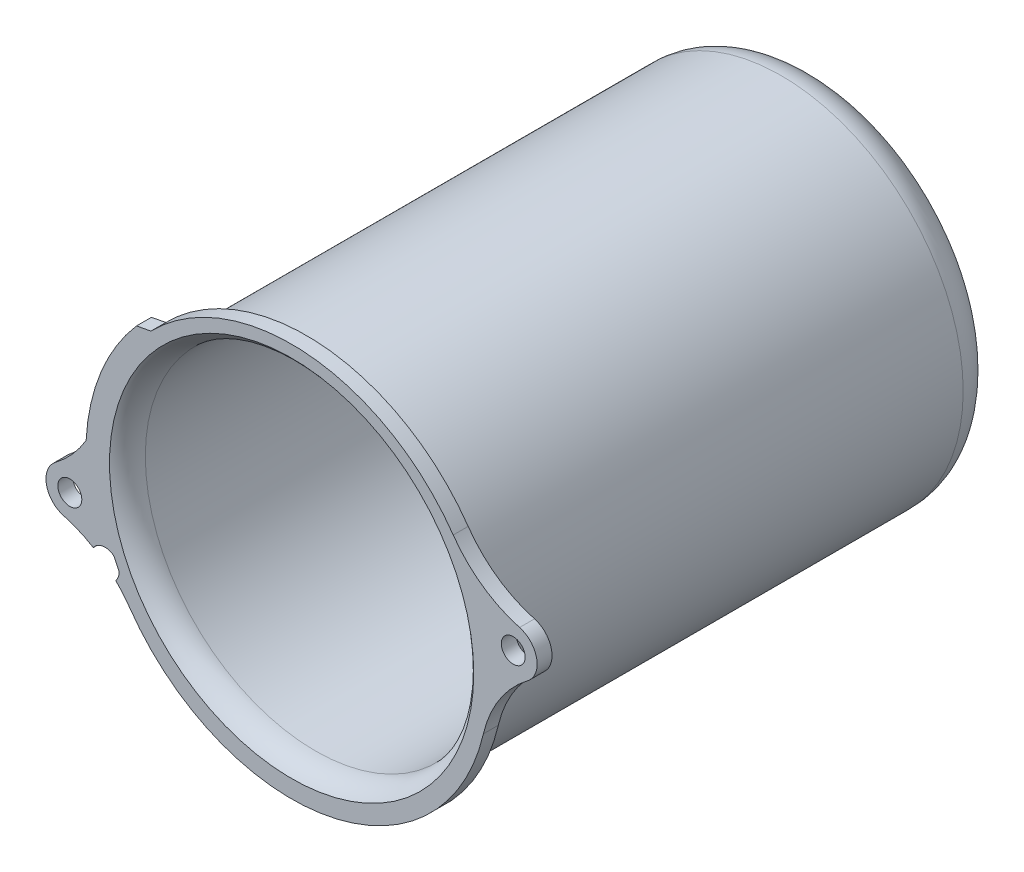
from build123d import *

# Parameters (mm, degrees)
ESQUISSE1_R          = 2
ESQUISSE1_R_2        = 31
BASE_EXTRUSION_DEPTH = 2.5


with BuildPart() as part:
    # Esquisse1 → Base-Extrusion (new body)
    with BuildSketch(Plane.XY):
        with BuildLine():
            Line((-23.568944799, 23.127218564), (-25.985846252, 22.667877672))
            ThreePointArc((-25.985846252, 22.667877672), (-31.952769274, 12.958758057), (-34.427057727, 1.834502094))
            ThreePointArc((-34.427057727, 1.834502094), (-36.71757785, -1.293387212), (-39.568531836, -3.92059777))
            ThreePointArc((-39.568531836, -3.92059777), (-41.084060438, -7.864835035), (-38.216117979, -10.967856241))
            ThreePointArc((-38.216117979, -10.967856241), (-35.643038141, -11.867938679), (-33.216253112, -13.109551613))
            ThreePointArc((-33.216253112, -13.109551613), (-29.807541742, -12.575727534), (-29.476662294, -16.010083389))
            ThreePointArc((-29.476662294, -16.010083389), (-28.22354999, -17.365107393), (-27.100684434, -18.829878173))
            ThreePointArc((-27.100684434, -18.829878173), (6.207299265, -32.391490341), (32.128854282, -7.463351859))
            ThreePointArc((32.128854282, -7.463351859), (34.835063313, -1.103826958), (39.544287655, 3.954861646))
            ThreePointArc((39.544287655, 3.954861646), (41.059816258, 7.899098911), (38.191873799, 11.002120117))
            ThreePointArc((38.191873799, 11.002120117), (31.944567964, 13.958180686), (27.076440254, 18.86414205))
            ThreePointArc((27.076440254, 18.86414205), (2.755864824, 32.900839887), (-23.568944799, 23.127218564))
        make_face()
        with Locations(Location((-37.155742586, -7.11096578, 0), (0, 0, 180))):
            Circle(ESQUISSE1_R, mode=Mode.SUBTRACT)
        with Locations((-0.01212209, 0.017131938)):
            Circle(ESQUISSE1_R_2, mode=Mode.SUBTRACT)
        with Locations((37.131498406, 7.145229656)):
            Circle(ESQUISSE1_R, mode=Mode.SUBTRACT)
    extrude(amount=BASE_EXTRUSION_DEPTH)

    # Esquisse2 → Boss.-R_vol.2 (revolve)
    with BuildSketch(Plane(origin=(0, 0, 0), x_dir=(0, 0, -1), z_dir=(1, 0, 0)), mode=Mode.PRIVATE) as boss_r_vol_2_sk:
        with BuildLine():
            Line((0, 32.5), (0, 33))
            Line((0, 33), (-2.5, 33))
            Line((-2.5, 33), (-2.5, 31))
            ThreePointArc((-2.5, 31), (-0.736067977, 29.527864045), (1.5, 29))
            Line((1.5, 29), (79.5, 29))
            ThreePointArc((79.5, 29), (82.328427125, 27.828427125), (83.5, 25))
            Line((83.5, 25), (83.5, 13.5))
            ThreePointArc((83.5, 13.5), (83.856617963, 12.081362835), (84.841687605, 11))
            Line((84.841687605, 11), (91.5, 11))
            Line((91.5, 11), (91.5, 10.232050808))
            ThreePointArc((91.5, 10.232050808), (92.232050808, 9.5), (92.5, 8.5))
            Line((92.5, 8.5), (92.5, 0.5))
            Line((92.5, 0.5), (94.5, 0.5))
            Line((94.5, 0.5), (94.5, 8.5))
            ThreePointArc((94.5, 8.5), (93.328427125, 11.328427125), (90.5, 12.5))
            Line((90.5, 12.5), (86.5, 12.5))
            ThreePointArc((86.5, 12.5), (85.792893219, 12.792893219), (85.5, 13.5))
            Line((85.5, 13.5), (85.5, 25))
            ThreePointArc((85.5, 25), (83.742640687, 29.242640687), (79.5, 31))
            Line((79.5, 31), (1.5, 31))
            ThreePointArc((1.5, 31), (0.439339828, 31.439339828), (0, 32.5))
        make_face()
    revolve(boss_r_vol_2_sk.sketch.rotate(Axis((0, 0.49, -0.231281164), (0, 0, -1)), 90), axis=Axis((0, 0.49, -0.231281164), (0, 0, -1)))


solid = part.part
